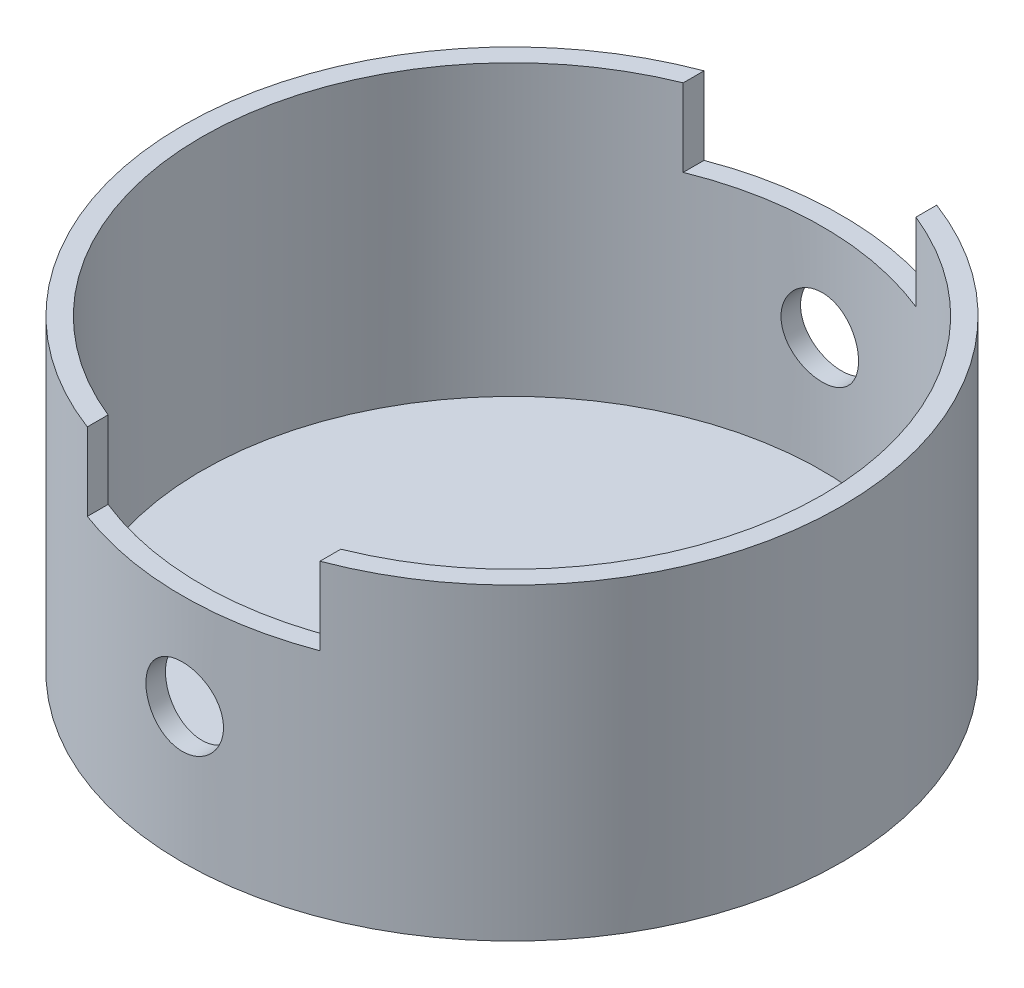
ISO-10303-21;
HEADER;
FILE_DESCRIPTION(('STEP AP214'),'2;1');
FILE_NAME('part.step','',(''),(''),'','','');
FILE_SCHEMA(('AUTOMOTIVE_DESIGN { 1 0 10303 214 1 1 1 1 }'));
ENDSEC;
DATA;
#1=APPLICATION_CONTEXT('core data for automotive mechanical design processes');
#2=APPLICATION_PROTOCOL_DEFINITION('international standard','automotive_design',2000,#1);
#3=PRODUCT_CONTEXT('',#1,'mechanical');
#4=PRODUCT('Part','Part','',(#3));
#5=PRODUCT_RELATED_PRODUCT_CATEGORY('part','',(#4));
#6=PRODUCT_DEFINITION_FORMATION('','',#4);
#7=PRODUCT_DEFINITION_CONTEXT('part definition',#1,'design');
#8=PRODUCT_DEFINITION('design','',#6,#7);
#9=PRODUCT_DEFINITION_SHAPE('','',#8);
#10=(LENGTH_UNIT() NAMED_UNIT(*) SI_UNIT(.MILLI.,.METRE.));
#11=(NAMED_UNIT(*) PLANE_ANGLE_UNIT() SI_UNIT($,.RADIAN.));
#12=(NAMED_UNIT(*) SI_UNIT($,.STERADIAN.) SOLID_ANGLE_UNIT());
#13=UNCERTAINTY_MEASURE_WITH_UNIT(LENGTH_MEASURE(1.E-05),#10,'distance_accuracy_value','');
#14=(GEOMETRIC_REPRESENTATION_CONTEXT(3) GLOBAL_UNCERTAINTY_ASSIGNED_CONTEXT((#13)) GLOBAL_UNIT_ASSIGNED_CONTEXT((#10,
#11,#12)) REPRESENTATION_CONTEXT('',''));
#15=CARTESIAN_POINT('',(0.,0.,0.));
#16=DIRECTION('',(0.,0.,1.));
#17=DIRECTION('',(1.,0.,0.));
#18=AXIS2_PLACEMENT_3D('',#15,#16,#17);
#19=CARTESIAN_POINT('',(0.,50.4952,0.));
#20=DIRECTION('',(0.,1.,0.));
#21=DIRECTION('',(0.,0.,1.));
#22=AXIS2_PLACEMENT_3D('',#19,#20,#21);
#23=PLANE('',#22);
#24=DIRECTION('',(0.,0.,1.));
#25=VECTOR('',#24,1.);
#26=CARTESIAN_POINT('',(-19.05,50.4952,-53.975));
#27=LINE('',#26,#25);
#28=CARTESIAN_POINT('',(-19.05,50.4952,-50.5014665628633));
#29=VERTEX_POINT('',#28);
#30=CARTESIAN_POINT('',(-19.05,50.4952,-47.0928603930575));
#31=VERTEX_POINT('',#30);
#32=EDGE_CURVE('E111',#29,#31,#27,.T.);
#33=ORIENTED_EDGE('',*,*,#32,.F.);
#34=CARTESIAN_POINT('',(0.,50.4952,0.));
#35=DIRECTION('',(0.,1.,0.));
#36=DIRECTION('',(0.,0.,1.));
#37=AXIS2_PLACEMENT_3D('',#34,#35,#36);
#38=CIRCLE('',#37,53.975);
#39=CARTESIAN_POINT('',(-19.05,50.4952,50.5014665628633));
#40=VERTEX_POINT('',#39);
#41=EDGE_CURVE('E149',#29,#40,#38,.T.);
#42=ORIENTED_EDGE('',*,*,#41,.T.);
#43=CARTESIAN_POINT('',(-19.05,50.4952,47.0928603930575));
#44=VERTEX_POINT('',#43);
#45=EDGE_CURVE('E189',#44,#40,#27,.T.);
#46=ORIENTED_EDGE('',*,*,#45,.F.);
#47=CARTESIAN_POINT('',(0.,50.4952,0.));
#48=DIRECTION('',(0.,1.,0.));
#49=DIRECTION('',(0.,0.,1.));
#50=AXIS2_PLACEMENT_3D('',#47,#48,#49);
#51=CIRCLE('',#50,50.8);
#52=EDGE_CURVE('E144',#31,#44,#51,.T.);
#53=ORIENTED_EDGE('',*,*,#52,.F.);
#54=EDGE_LOOP('',(#33,#42,#46,#53));
#55=FACE_BOUND('',#54,.T.);
#56=ADVANCED_FACE('F30',(#55),#23,.T.);
#57=CARTESIAN_POINT('',(0.,50.4952,0.));
#58=DIRECTION('',(0.,-1.,0.));
#59=DIRECTION('',(0.,0.,-1.));
#60=AXIS2_PLACEMENT_3D('',#57,#58,#59);
#61=CYLINDRICAL_SURFACE('',#60,53.975);
#62=CARTESIAN_POINT('',(0.,28.4226,-53.975));
#63=CARTESIAN_POINT('',(-0.177745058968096,28.4226019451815,-53.9750006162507));
#64=CARTESIAN_POINT('',(-0.355461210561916,28.415134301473,-53.9741202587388));
#65=CARTESIAN_POINT('',(-0.709680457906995,28.3853204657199,-53.9706247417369));
#66=CARTESIAN_POINT('',(-0.886183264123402,28.3629708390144,-53.9680091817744));
#67=CARTESIAN_POINT('',(-1.23678996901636,28.3035303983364,-53.9611133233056));
#68=CARTESIAN_POINT('',(-1.41089193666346,28.2664283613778,-53.9568317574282));
#69=CARTESIAN_POINT('',(-1.75538998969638,28.1777414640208,-53.9467231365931));
#70=CARTESIAN_POINT('',(-1.92578469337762,28.1261513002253,-53.9408955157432));
#71=CARTESIAN_POINT('',(-2.26142296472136,28.0089316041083,-53.9278663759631));
#72=CARTESIAN_POINT('',(-2.42667163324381,27.9433165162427,-53.9206662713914));
#73=CARTESIAN_POINT('',(-2.75110129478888,27.798463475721,-53.905087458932));
#74=CARTESIAN_POINT('',(-2.91028002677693,27.7192205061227,-53.8967083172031));
#75=CARTESIAN_POINT('',(-3.2213079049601,27.547743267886,-53.8790131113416));
#76=CARTESIAN_POINT('',(-3.37316107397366,27.4555162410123,-53.8696975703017));
#77=CARTESIAN_POINT('',(-3.66863392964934,27.2586535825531,-53.8503823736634));
#78=CARTESIAN_POINT('',(-3.81225054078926,27.154013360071,-53.8403824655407));
#79=CARTESIAN_POINT('',(-4.09075266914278,26.9326423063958,-53.8199400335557));
#80=CARTESIAN_POINT('',(-4.22560091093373,26.8158647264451,-53.8094958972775));
#81=CARTESIAN_POINT('',(-4.4850422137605,26.5713424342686,-53.7884929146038));
#82=CARTESIAN_POINT('',(-4.6096314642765,26.4435936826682,-53.7779340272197));
#83=CARTESIAN_POINT('',(-4.84758996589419,26.1781010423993,-53.7570066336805));
#84=CARTESIAN_POINT('',(-4.96096277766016,26.0403603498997,-53.7466380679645));
#85=CARTESIAN_POINT('',(-5.17577623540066,25.75575607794,-53.7263772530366));
#86=CARTESIAN_POINT('',(-5.27721246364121,25.6088891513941,-53.7164851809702));
#87=CARTESIAN_POINT('',(-5.46763329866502,25.3067088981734,-53.69743751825));
#88=CARTESIAN_POINT('',(-5.55658474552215,25.1513745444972,-53.6882839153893));
#89=CARTESIAN_POINT('',(-5.72111142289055,24.8336515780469,-53.671001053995));
#90=CARTESIAN_POINT('',(-5.79668168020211,24.6712603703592,-53.6628721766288));
#91=CARTESIAN_POINT('',(-5.93382829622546,24.3406773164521,-53.647880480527));
#92=CARTESIAN_POINT('',(-5.99541018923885,24.172487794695,-53.641017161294));
#93=CARTESIAN_POINT('',(-6.10418310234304,23.8314480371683,-53.6287471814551));
#94=CARTESIAN_POINT('',(-6.15136883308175,23.6585961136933,-53.6233410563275));
#95=CARTESIAN_POINT('',(-6.27032220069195,23.1366384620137,-53.6096110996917));
#96=CARTESIAN_POINT('',(-6.32027807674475,22.7822153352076,-53.6036860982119));
#97=CARTESIAN_POINT('',(-6.36001759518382,22.070163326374,-53.5989845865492));
#98=CARTESIAN_POINT('',(-6.34980339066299,21.7125345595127,-53.6002078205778));
#99=CARTESIAN_POINT('',(-6.26979696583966,21.0058890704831,-53.6096246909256));
#100=CARTESIAN_POINT('',(-6.20030552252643,20.6568380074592,-53.6177831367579));
#101=CARTESIAN_POINT('',(-6.00416501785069,19.975400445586,-53.6400995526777));
#102=CARTESIAN_POINT('',(-5.87751491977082,19.6430142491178,-53.6542576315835));
#103=CARTESIAN_POINT('',(-5.57033173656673,19.0033851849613,-53.6870173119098));
#104=CARTESIAN_POINT('',(-5.38966704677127,18.6962060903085,-53.7056297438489));
#105=CARTESIAN_POINT('',(-4.97967585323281,18.1164140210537,-53.7451926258));
#106=CARTESIAN_POINT('',(-4.75034737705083,17.8438024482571,-53.7661431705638));
#107=CARTESIAN_POINT('',(-4.24786730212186,17.3391357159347,-53.8081782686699));
#108=CARTESIAN_POINT('',(-3.97445621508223,17.1073388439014,-53.829262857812));
#109=CARTESIAN_POINT('',(-3.39246779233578,16.692889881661,-53.869070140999));
#110=CARTESIAN_POINT('',(-3.08389039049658,16.5102378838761,-53.8877928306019));
#111=CARTESIAN_POINT('',(-2.44013596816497,16.1992665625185,-53.9207765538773));
#112=CARTESIAN_POINT('',(-2.10495153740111,16.0709624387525,-53.9350363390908));
#113=CARTESIAN_POINT('',(-1.41759135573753,15.8725290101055,-53.9574758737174));
#114=CARTESIAN_POINT('',(-1.06541630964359,15.8023972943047,-53.9656558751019));
#115=CARTESIAN_POINT('',(-0.35630624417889,15.7226319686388,-53.9749815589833));
#116=CARTESIAN_POINT('',(0.000588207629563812,15.7126423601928,-53.9761686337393));
#117=CARTESIAN_POINT('',(0.710966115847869,15.7525067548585,-53.9714862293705));
#118=CARTESIAN_POINT('',(1.06444963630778,15.8023596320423,-53.9656168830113));
#119=CARTESIAN_POINT('',(1.75692840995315,15.9601982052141,-53.9475070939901));
#120=CARTESIAN_POINT('',(2.09596265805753,16.068015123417,-53.9352851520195));
#121=CARTESIAN_POINT('',(2.75113641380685,16.3385465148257,-53.9058393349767));
#122=CARTESIAN_POINT('',(3.06727522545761,16.5012626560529,-53.8886153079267));
#123=CARTESIAN_POINT('',(3.6692802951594,16.8778413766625,-53.8509842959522));
#124=CARTESIAN_POINT('',(3.95500087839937,17.0919353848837,-53.8305630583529));
#125=CARTESIAN_POINT('',(4.48657908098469,17.5648649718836,-53.7888693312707));
#126=CARTESIAN_POINT('',(4.73243530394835,17.8237021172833,-53.7675968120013));
#127=CARTESIAN_POINT('',(5.17856086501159,18.3803293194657,-53.7264711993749));
#128=CARTESIAN_POINT('',(5.37859495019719,18.6783085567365,-53.706625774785));
#129=CARTESIAN_POINT('',(5.72577355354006,19.3038564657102,-53.6707251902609));
#130=CARTESIAN_POINT('',(5.87291902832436,19.6314246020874,-53.654669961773));
#131=CARTESIAN_POINT('',(6.1097650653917,20.3060108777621,-53.6282167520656));
#132=CARTESIAN_POINT('',(6.19960057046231,20.6529812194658,-53.6178054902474));
#133=CARTESIAN_POINT('',(6.31968777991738,21.3574074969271,-53.6037871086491));
#134=CARTESIAN_POINT('',(6.34994191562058,21.7148630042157,-53.6001797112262));
#135=CARTESIAN_POINT('',(6.35002884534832,22.249589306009,-53.6001637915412));
#136=CARTESIAN_POINT('',(6.34258489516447,22.4271378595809,-53.6010486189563));
#137=CARTESIAN_POINT('',(6.31285908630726,22.7809533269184,-53.6045586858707));
#138=CARTESIAN_POINT('',(6.29058274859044,22.9572206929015,-53.6071832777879));
#139=CARTESIAN_POINT('',(6.23133914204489,23.307288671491,-53.6141017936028));
#140=CARTESIAN_POINT('',(6.19436651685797,23.4810883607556,-53.6183963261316));
#141=CARTESIAN_POINT('',(6.10602196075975,23.824877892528,-53.6285287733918));
#142=CARTESIAN_POINT('',(6.05465527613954,23.9948690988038,-53.6343661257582));
#143=CARTESIAN_POINT('',(5.93788577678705,24.3299192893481,-53.6474191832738));
#144=CARTESIAN_POINT('',(5.87248185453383,24.4949778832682,-53.654634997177));
#145=CARTESIAN_POINT('',(5.72813847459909,24.8189364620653,-53.6702368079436));
#146=CARTESIAN_POINT('',(5.64920394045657,24.9778386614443,-53.6786223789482));
#147=CARTESIAN_POINT('',(5.47831419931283,25.2885001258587,-53.69633205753));
#148=CARTESIAN_POINT('',(5.38635427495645,25.4402567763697,-53.7056565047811));
#149=CARTESIAN_POINT('',(5.19011973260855,25.7354622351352,-53.7249755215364));
#150=CARTESIAN_POINT('',(5.085849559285,25.8789140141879,-53.7349698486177));
#151=CARTESIAN_POINT('',(4.8650042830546,26.1574525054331,-53.7554158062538));
#152=CARTESIAN_POINT('',(4.74835606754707,26.292481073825,-53.7658699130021));
#153=CARTESIAN_POINT('',(4.50416326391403,26.5521951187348,-53.7868770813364));
#154=CARTESIAN_POINT('',(4.37662264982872,26.6768843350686,-53.7974301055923));
#155=CARTESIAN_POINT('',(4.11141832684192,26.9151754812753,-53.8183478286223));
#156=CARTESIAN_POINT('',(3.97374853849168,27.0287706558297,-53.8287124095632));
#157=CARTESIAN_POINT('',(3.68936773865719,27.2439487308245,-53.8489507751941));
#158=CARTESIAN_POINT('',(3.54266008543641,27.3455360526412,-53.8588247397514));
#159=CARTESIAN_POINT('',(3.24061319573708,27.5363861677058,-53.8778435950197));
#160=CARTESIAN_POINT('',(3.08524353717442,27.6256011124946,-53.8869856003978));
#161=CARTESIAN_POINT('',(2.7675370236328,27.7905775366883,-53.9042360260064));
#162=CARTESIAN_POINT('',(2.60520275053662,27.8663439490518,-53.9123448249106));
#163=CARTESIAN_POINT('',(2.27479166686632,28.003857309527,-53.9272960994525));
#164=CARTESIAN_POINT('',(2.10671952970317,28.0656153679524,-53.9341395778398));
#165=CARTESIAN_POINT('',(1.76596873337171,28.1747194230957,-53.9463720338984));
#166=CARTESIAN_POINT('',(1.59329118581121,28.2220688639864,-53.9517613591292));
#167=CARTESIAN_POINT('',(1.18649345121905,28.3153188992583,-53.9624574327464));
#168=CARTESIAN_POINT('',(0.951024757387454,28.3555087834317,-53.9671415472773));
#169=CARTESIAN_POINT('',(0.477020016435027,28.4091479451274,-53.9734124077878));
#170=CARTESIAN_POINT('',(0.238483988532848,28.4225973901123,-53.9749991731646));
#171=CARTESIAN_POINT('',(0.,28.4226,-53.975));
#172=B_SPLINE_CURVE_WITH_KNOTS('',3,(#62,#63,#64,#65,#66,#67,#68,#69,#70,#71,#72,#73,#74,#75,
#76,#77,#78,#79,#80,#81,#82,#83,#84,#85,#86,#87,#88,#89,#90,#91,#92,#93,#94,#95,#96,#97,#98,#99,
#100,#101,#102,#103,#104,#105,#106,#107,#108,#109,#110,#111,#112,#113,#114,#115,#116,#117,#118,
#119,#120,#121,#122,#123,#124,#125,#126,#127,#128,#129,#130,#131,#132,#133,#134,#135,#136,#137,
#138,#139,#140,#141,#142,#143,#144,#145,#146,#147,#148,#149,#150,#151,#152,#153,#154,#155,#156,
#157,#158,#159,#160,#161,#162,#163,#164,#165,#166,#167,#168,#169,#170,#171),.UNSPECIFIED.,.T.,
.F.,(4,2,2,2,2,2,2,2,2,2,2,2,2,2,2,2,2,2,2,2,2,2,2,2,2,2,2,2,2,2,2,2,2,2,2,2,2,2,2,2,2,2,2,2,2,
2,2,2,2,2,2,2,2,2,4),(0.,0.533026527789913,1.06617611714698,1.59973208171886,2.13348361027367,
2.66668804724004,3.20008919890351,3.73319401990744,4.26649662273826,4.80193530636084,
5.33757198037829,5.87303806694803,6.40870171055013,6.94576220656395,7.48302188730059,
8.02006863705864,8.55731246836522,9.62565526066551,10.6939598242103,11.7568757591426,
12.8198109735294,13.8853573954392,14.9509470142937,16.023054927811,17.0951648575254,
18.1675744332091,19.2399395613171,20.3059507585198,21.3719418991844,22.4348458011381,
23.4977820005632,24.5655991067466,25.633453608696,26.7066734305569,27.7798738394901,
28.8505378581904,29.9211581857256,30.4537600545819,30.9861637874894,31.5187617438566,
32.0511658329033,32.5836119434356,33.1158647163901,33.6483107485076,34.1805651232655,
34.7161596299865,35.2515595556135,35.7872834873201,36.3228095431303,36.8603521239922,
37.3976971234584,37.9346144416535,38.4714033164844,39.1865798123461,39.9017518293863),.UNSPECIFIED.);
#173=CARTESIAN_POINT('',(0.,28.4226,-53.975));
#174=VERTEX_POINT('',#173);
#175=EDGE_CURVE('E133',#174,#174,#172,.T.);
#176=ORIENTED_EDGE('',*,*,#175,.T.);
#177=EDGE_LOOP('',(#176));
#178=FACE_BOUND('',#177,.T.);
#179=CARTESIAN_POINT('',(6.35,22.0726,53.6001690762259));
#180=CARTESIAN_POINT('',(6.35000194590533,21.8948597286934,53.6001684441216));
#181=CARTESIAN_POINT('',(6.34253470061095,21.7171483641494,53.6010549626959));
#182=CARTESIAN_POINT('',(6.31272249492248,21.3629388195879,53.6045743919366));
#183=CARTESIAN_POINT('',(6.29037409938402,21.1864409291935,53.6072077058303));
#184=CARTESIAN_POINT('',(6.23093702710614,20.8358441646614,53.6141486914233));
#185=CARTESIAN_POINT('',(6.19383712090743,20.6617472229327,53.6184576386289));
#186=CARTESIAN_POINT('',(6.10515548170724,20.3172593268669,53.628627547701));
#187=CARTESIAN_POINT('',(6.05356844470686,20.1468697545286,53.6344890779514));
#188=CARTESIAN_POINT('',(5.93635630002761,19.8112423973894,53.6475886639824));
#189=CARTESIAN_POINT('',(5.87074569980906,19.6459994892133,53.6548252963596));
#190=CARTESIAN_POINT('',(5.7259027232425,19.3215808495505,53.6704757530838));
#191=CARTESIAN_POINT('',(5.64666533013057,19.1624073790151,53.6788900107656));
#192=CARTESIAN_POINT('',(5.47520009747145,18.8513890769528,53.6966500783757));
#193=CARTESIAN_POINT('',(5.38297949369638,18.6995402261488,53.7059953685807));
#194=CARTESIAN_POINT('',(5.18613027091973,18.404074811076,53.7253614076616));
#195=CARTESIAN_POINT('',(5.08149706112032,18.2604613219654,53.7353824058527));
#196=CARTESIAN_POINT('',(4.86013300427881,17.9819548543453,53.7558567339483));
#197=CARTESIAN_POINT('',(4.74335463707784,17.8470997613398,53.7663116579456));
#198=CARTESIAN_POINT('',(4.49882932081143,17.5876446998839,53.7873239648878));
#199=CARTESIAN_POINT('',(4.37107833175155,17.4630485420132,53.7978813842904));
#200=CARTESIAN_POINT('',(4.1055798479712,17.2250765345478,53.8187937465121));
#201=CARTESIAN_POINT('',(3.96783555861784,17.1116971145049,53.8291487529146));
#202=CARTESIAN_POINT('',(3.68322274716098,16.896870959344,53.8493718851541));
#203=CARTESIAN_POINT('',(3.53635087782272,16.7954286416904,53.859239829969));
#204=CARTESIAN_POINT('',(3.23416674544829,16.6050009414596,53.8782308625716));
#205=CARTESIAN_POINT('',(3.07883383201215,16.5160481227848,53.8873519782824));
#206=CARTESIAN_POINT('',(2.76111364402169,16.3515185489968,53.9045656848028));
#207=CARTESIAN_POINT('',(2.59872377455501,16.2759467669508,53.9126578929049));
#208=CARTESIAN_POINT('',(2.2681434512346,16.1387970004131,53.9275762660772));
#209=CARTESIAN_POINT('',(2.09995531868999,16.0772134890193,53.9344029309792));
#210=CARTESIAN_POINT('',(1.75891861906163,15.9684372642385,53.9466037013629));
#211=CARTESIAN_POINT('',(1.58606836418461,15.9212498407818,53.9519772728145));
#212=CARTESIAN_POINT('',(1.06411813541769,15.8022915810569,53.9656219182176));
#213=CARTESIAN_POINT('',(0.709701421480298,15.7523319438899,53.9715060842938));
#214=CARTESIAN_POINT('',(-0.00233801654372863,15.7125826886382,53.9761763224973));
#215=CARTESIAN_POINT('',(-0.359960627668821,15.7227909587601,53.9749626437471));
#216=CARTESIAN_POINT('',(-1.06663214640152,15.8027879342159,53.9656105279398));
#217=CARTESIAN_POINT('',(-1.41571469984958,15.8722818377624,53.9575063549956));
#218=CARTESIAN_POINT('',(-2.09721396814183,16.0684381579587,53.9353193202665));
#219=CARTESIAN_POINT('',(-2.42963039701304,16.1951015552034,53.921236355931));
#220=CARTESIAN_POINT('',(-3.06929631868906,16.5023123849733,53.8886161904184));
#221=CARTESIAN_POINT('',(-3.37648353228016,16.682988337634,53.8700683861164));
#222=CARTESIAN_POINT('',(-3.95628707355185,17.0930036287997,53.8305953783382));
#223=CARTESIAN_POINT('',(-4.22890199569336,17.3223449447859,53.8096700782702));
#224=CARTESIAN_POINT('',(-4.73355442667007,17.8248341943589,53.7676364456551));
#225=CARTESIAN_POINT('',(-4.96533623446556,18.0982389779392,53.7465277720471));
#226=CARTESIAN_POINT('',(-5.37975779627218,18.6802093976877,53.706631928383));
#227=CARTESIAN_POINT('',(-5.5623974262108,18.9887751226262,53.6878447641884));
#228=CARTESIAN_POINT('',(-5.87335982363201,19.632526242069,53.6547188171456));
#229=CARTESIAN_POINT('',(-6.00166359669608,19.9677208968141,53.6403815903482));
#230=CARTESIAN_POINT('',(-6.20009319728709,20.6551033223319,53.6178098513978));
#231=CARTESIAN_POINT('',(-6.27022149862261,21.0072903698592,53.6095750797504));
#232=CARTESIAN_POINT('',(-6.34997392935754,21.71640623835,53.6001873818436));
#233=CARTESIAN_POINT('',(-6.3599572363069,22.0732941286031,53.5989924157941));
#234=CARTESIAN_POINT('',(-6.32008258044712,22.7836574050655,53.603708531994));
#235=CARTESIAN_POINT('',(-6.27022574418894,23.1371328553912,53.6096194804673));
#236=CARTESIAN_POINT('',(-6.11238789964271,23.8295703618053,53.6278430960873));
#237=CARTESIAN_POINT('',(-6.00457951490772,24.1685723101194,53.6401367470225));
#238=CARTESIAN_POINT('',(-5.7340759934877,24.8236852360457,53.66972518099));
#239=CARTESIAN_POINT('',(-5.57137913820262,25.1397954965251,53.6870201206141));
#240=CARTESIAN_POINT('',(-5.19482900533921,25.7417807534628,53.7247635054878));
#241=CARTESIAN_POINT('',(-4.98073940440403,26.0275070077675,53.7452263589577));
#242=CARTESIAN_POINT('',(-4.50781526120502,26.5590987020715,53.7869540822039));
#243=CARTESIAN_POINT('',(-4.24897918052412,26.804962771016,53.8082189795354));
#244=CARTESIAN_POINT('',(-3.69234862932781,27.2511058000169,53.8492833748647));
#245=CARTESIAN_POINT('',(-3.39436477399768,27.451149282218,53.8690749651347));
#246=CARTESIAN_POINT('',(-2.76880507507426,27.7983443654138,53.9048450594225));
#247=CARTESIAN_POINT('',(-2.44122976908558,27.9454969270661,53.9208236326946));
#248=CARTESIAN_POINT('',(-1.76664760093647,28.1823475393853,53.9471339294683));
#249=CARTESIAN_POINT('',(-1.41968962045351,28.2721836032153,53.9574792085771));
#250=CARTESIAN_POINT('',(-0.715289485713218,28.3922761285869,53.9714064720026));
#251=CARTESIAN_POINT('',(-0.357847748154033,28.4225349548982,53.9749887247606));
#252=CARTESIAN_POINT('',(0.176875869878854,28.4226322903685,53.9750056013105));
#253=CARTESIAN_POINT('',(0.354434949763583,28.4151909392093,53.9741273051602));
#254=CARTESIAN_POINT('',(0.708271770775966,28.3854685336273,53.9706416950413));
#255=CARTESIAN_POINT('',(0.884549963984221,28.3631930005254,53.9680350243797));
#256=CARTESIAN_POINT('',(1.23463975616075,28.3039491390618,53.9611618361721));
#257=CARTESIAN_POINT('',(1.40845043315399,28.2669754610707,53.9568947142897));
#258=CARTESIAN_POINT('',(1.75226196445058,28.1786268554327,53.9468234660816));
#259=CARTESIAN_POINT('',(1.92226418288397,28.127257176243,53.9410198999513));
#260=CARTESIAN_POINT('',(2.25733708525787,28.0104793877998,53.9280369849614));
#261=CARTESIAN_POINT('',(2.42240734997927,27.9450700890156,53.9208575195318));
#262=CARTESIAN_POINT('',(2.74638844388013,27.8007139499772,53.9053269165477));
#263=CARTESIAN_POINT('',(2.9053014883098,27.7217720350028,53.8969762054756));
#264=CARTESIAN_POINT('',(3.21598328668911,27.5508657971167,53.8793308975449));
#265=CARTESIAN_POINT('',(3.36774942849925,27.4588967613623,53.8700359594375));
#266=CARTESIAN_POINT('',(3.66297213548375,27.262642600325,53.850767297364));
#267=CARTESIAN_POINT('',(3.80643167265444,27.158361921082,53.8407938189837));
#268=CARTESIAN_POINT('',(4.08496993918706,26.9375054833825,53.8203796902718));
#269=CARTESIAN_POINT('',(4.21999143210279,26.8208577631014,53.8099365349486));
#270=CARTESIAN_POINT('',(4.47969125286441,26.5766674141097,53.7889390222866));
#271=CARTESIAN_POINT('',(4.60437332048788,26.4491287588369,53.7783847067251));
#272=CARTESIAN_POINT('',(4.84265042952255,26.1839297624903,53.7574523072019));
#273=CARTESIAN_POINT('',(4.95623870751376,26.0462633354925,53.7470743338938));
#274=CARTESIAN_POINT('',(5.17140349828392,25.7618906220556,53.7267985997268));
#275=CARTESIAN_POINT('',(5.27298443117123,25.6151876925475,53.7169006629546));
#276=CARTESIAN_POINT('',(5.46382704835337,25.3131443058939,53.6978254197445));
#277=CARTESIAN_POINT('',(5.55304029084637,25.157773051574,53.6886510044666));
#278=CARTESIAN_POINT('',(5.71801314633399,24.8400634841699,53.6713315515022));
#279=CARTESIAN_POINT('',(5.79377769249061,24.6777277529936,53.6631861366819));
#280=CARTESIAN_POINT('',(5.93128720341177,24.3473137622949,53.6481616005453));
#281=CARTESIAN_POINT('',(5.99304328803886,24.1792401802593,53.6412814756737));
#282=CARTESIAN_POINT('',(6.10214331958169,23.8384862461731,53.6289798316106));
#283=CARTESIAN_POINT('',(6.1494907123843,23.6658070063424,53.6235579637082));
#284=CARTESIAN_POINT('',(6.24273196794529,23.2590216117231,53.6127955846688));
#285=CARTESIAN_POINT('',(6.28291693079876,23.0235672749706,53.6080805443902));
#286=CARTESIAN_POINT('',(6.33654955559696,22.5495912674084,53.6017677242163));
#287=CARTESIAN_POINT('',(6.34999738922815,22.3110696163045,53.6001699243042));
#288=CARTESIAN_POINT('',(6.35,22.0726,53.6001690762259));
#289=B_SPLINE_CURVE_WITH_KNOTS('',3,(#179,#180,#181,#182,#183,#184,#185,#186,#187,#188,#189,
#190,#191,#192,#193,#194,#195,#196,#197,#198,#199,#200,#201,#202,#203,#204,#205,#206,#207,#208,
#209,#210,#211,#212,#213,#214,#215,#216,#217,#218,#219,#220,#221,#222,#223,#224,#225,#226,#227,
#228,#229,#230,#231,#232,#233,#234,#235,#236,#237,#238,#239,#240,#241,#242,#243,#244,#245,#246,
#247,#248,#249,#250,#251,#252,#253,#254,#255,#256,#257,#258,#259,#260,#261,#262,#263,#264,#265,
#266,#267,#268,#269,#270,#271,#272,#273,#274,#275,#276,#277,#278,#279,#280,#281,#282,#283,#284,
#285,#286,#287,#288),.UNSPECIFIED.,.T.,.F.,(4,2,2,2,2,2,2,2,2,2,2,2,2,2,2,2,2,2,2,2,2,2,2,2,2,2,
2,2,2,2,2,2,2,2,2,2,2,2,2,2,2,2,2,2,2,2,2,2,2,2,2,2,2,2,4),(0.,0.533012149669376,
1.06614738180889,1.59968923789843,2.13342668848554,2.66661463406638,3.19999929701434,
3.73308786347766,4.26637421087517,4.80183179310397,5.33748737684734,5.87297190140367,
6.40865396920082,6.94570776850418,7.48296074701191,8.02000108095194,8.5572385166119,
9.62556291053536,10.6938498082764,11.7568553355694,12.8198790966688,13.8854526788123,
14.9510695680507,16.0231390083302,17.0952111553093,18.1676577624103,19.2400587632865,
20.3060491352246,21.3720194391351,22.4348319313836,23.497677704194,24.5655077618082,
25.6333745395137,26.7066118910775,27.7798297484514,28.8504535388,29.9210348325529,
30.4536678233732,30.9861026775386,31.518731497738,32.0511663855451,32.5836464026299,
33.1159330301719,33.6484127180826,34.1807006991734,34.7162763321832,35.2516573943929,
35.7873628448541,36.3228704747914,36.8604196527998,37.3977712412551,37.9346947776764,
38.4714898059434,39.1866232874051,39.9017521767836),.UNSPECIFIED.);
#290=CARTESIAN_POINT('',(6.35,22.0726,53.6001690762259));
#291=VERTEX_POINT('',#290);
#292=EDGE_CURVE('E182',#291,#291,#289,.T.);
#293=ORIENTED_EDGE('',*,*,#292,.T.);
#294=EDGE_LOOP('',(#293));
#295=FACE_BOUND('',#294,.T.);
#296=CARTESIAN_POINT('',(19.05,50.4952,50.5014665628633));
#297=VERTEX_POINT('',#296);
#298=CARTESIAN_POINT('',(19.05,50.4952,-50.5014665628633));
#299=VERTEX_POINT('',#298);
#300=EDGE_CURVE('E152',#297,#299,#38,.T.);
#301=ORIENTED_EDGE('',*,*,#300,.F.);
#302=DIRECTION('',(0.,-1.,0.));
#303=VECTOR('',#302,1.);
#304=CARTESIAN_POINT('',(19.05,50.4952,50.5014665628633));
#305=LINE('',#304,#303);
#306=CARTESIAN_POINT('',(19.05,37.7952,50.5014665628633));
#307=VERTEX_POINT('',#306);
#308=EDGE_CURVE('E120',#297,#307,#305,.T.);
#309=ORIENTED_EDGE('',*,*,#308,.T.);
#310=CARTESIAN_POINT('',(0.,37.7952,0.));
#311=DIRECTION('',(0.,-1.,0.));
#312=DIRECTION('',(1.,0.,0.));
#313=AXIS2_PLACEMENT_3D('',#310,#311,#312);
#314=CIRCLE('',#313,53.975);
#315=CARTESIAN_POINT('',(-19.05,37.7952,50.5014665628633));
#316=VERTEX_POINT('',#315);
#317=EDGE_CURVE('E110',#307,#316,#314,.T.);
#318=ORIENTED_EDGE('',*,*,#317,.T.);
#319=DIRECTION('',(0.,-1.,0.));
#320=VECTOR('',#319,1.);
#321=CARTESIAN_POINT('',(-19.05,50.4952,50.5014665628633));
#322=LINE('',#321,#320);
#323=EDGE_CURVE('E137',#316,#40,#322,.F.);
#324=ORIENTED_EDGE('',*,*,#323,.T.);
#325=ORIENTED_EDGE('',*,*,#41,.F.);
#326=DIRECTION('',(0.,-1.,0.));
#327=VECTOR('',#326,1.);
#328=CARTESIAN_POINT('',(-19.05,50.4952,-50.5014665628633));
#329=LINE('',#328,#327);
#330=CARTESIAN_POINT('',(-19.05,37.7952,-50.5014665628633));
#331=VERTEX_POINT('',#330);
#332=EDGE_CURVE('E108',#29,#331,#329,.T.);
#333=ORIENTED_EDGE('',*,*,#332,.T.);
#334=CARTESIAN_POINT('',(19.05,37.7952,-50.5014665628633));
#335=VERTEX_POINT('',#334);
#336=EDGE_CURVE('E101',#331,#335,#314,.T.);
#337=ORIENTED_EDGE('',*,*,#336,.T.);
#338=DIRECTION('',(0.,-1.,0.));
#339=VECTOR('',#338,1.);
#340=CARTESIAN_POINT('',(19.05,50.4952,-50.5014665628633));
#341=LINE('',#340,#339);
#342=EDGE_CURVE('E105',#335,#299,#341,.F.);
#343=ORIENTED_EDGE('',*,*,#342,.T.);
#344=EDGE_LOOP('',(#301,#309,#318,#324,#325,#333,#337,#343));
#345=FACE_BOUND('',#344,.T.);
#346=CARTESIAN_POINT('',(0.,0.,0.));
#347=DIRECTION('',(0.,1.,0.));
#348=DIRECTION('',(0.,0.,1.));
#349=AXIS2_PLACEMENT_3D('',#346,#347,#348);
#350=CIRCLE('',#349,53.975);
#351=CARTESIAN_POINT('',(0.,0.,53.975));
#352=VERTEX_POINT('',#351);
#353=EDGE_CURVE('E148',#352,#352,#350,.T.);
#354=ORIENTED_EDGE('',*,*,#353,.T.);
#355=EDGE_LOOP('',(#354));
#356=FACE_BOUND('',#355,.T.);
#357=ADVANCED_FACE('F32',(#178,#295,#345,#356),#61,.T.);
#358=DIRECTION('',(0.,0.,1.));
#359=VECTOR('',#358,1.);
#360=CARTESIAN_POINT('',(19.05,50.4952,-53.975));
#361=LINE('',#360,#359);
#362=CARTESIAN_POINT('',(19.05,50.4952,47.0928603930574));
#363=VERTEX_POINT('',#362);
#364=EDGE_CURVE('E125',#363,#297,#361,.T.);
#365=ORIENTED_EDGE('',*,*,#364,.T.);
#366=ORIENTED_EDGE('',*,*,#300,.T.);
#367=CARTESIAN_POINT('',(19.05,50.4952,-47.0928603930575));
#368=VERTEX_POINT('',#367);
#369=EDGE_CURVE('E119',#299,#368,#361,.T.);
#370=ORIENTED_EDGE('',*,*,#369,.T.);
#371=EDGE_CURVE('E145',#363,#368,#51,.T.);
#372=ORIENTED_EDGE('',*,*,#371,.F.);
#373=EDGE_LOOP('',(#365,#366,#370,#372));
#374=FACE_BOUND('',#373,.T.);
#375=ADVANCED_FACE('F195',(#374),#23,.T.);
#376=CARTESIAN_POINT('',(0.,0.,0.));
#377=DIRECTION('',(0.,1.,0.));
#378=DIRECTION('',(0.,0.,1.));
#379=AXIS2_PLACEMENT_3D('',#376,#377,#378);
#380=PLANE('',#379);
#381=ORIENTED_EDGE('',*,*,#353,.F.);
#382=EDGE_LOOP('',(#381));
#383=FACE_BOUND('',#382,.T.);
#384=ADVANCED_FACE('F222',(#383),#380,.F.);
#385=CARTESIAN_POINT('',(0.,50.4952,0.));
#386=DIRECTION('',(0.,-1.,0.));
#387=DIRECTION('',(0.,0.,-1.));
#388=AXIS2_PLACEMENT_3D('',#385,#386,#387);
#389=CYLINDRICAL_SURFACE('',#388,50.8);
#390=CARTESIAN_POINT('',(0.,28.4226,-50.8));
#391=CARTESIAN_POINT('',(-0.177660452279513,28.4226020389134,-50.800000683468));
#392=CARTESIAN_POINT('',(-0.35529097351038,28.4151414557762,-50.7990661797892));
#393=CARTESIAN_POINT('',(-0.709338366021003,28.3853564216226,-50.7953557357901));
#394=CARTESIAN_POINT('',(-0.885754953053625,28.3630286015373,-50.7925793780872));
#395=CARTESIAN_POINT('',(-1.23618570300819,28.3036476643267,-50.7852595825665));
#396=CARTESIAN_POINT('',(-1.4101979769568,28.2665835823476,-50.780714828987));
#397=CARTESIAN_POINT('',(-1.75451712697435,28.1779895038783,-50.7699847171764));
#398=CARTESIAN_POINT('',(-1.92482262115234,28.1264542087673,-50.7637987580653));
#399=CARTESIAN_POINT('',(-2.26028082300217,28.0093633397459,-50.7499683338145));
#400=CARTESIAN_POINT('',(-2.42543874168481,27.943822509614,-50.7423254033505));
#401=CARTESIAN_POINT('',(-2.74969172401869,27.7991369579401,-50.7257879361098));
#402=CARTESIAN_POINT('',(-2.90878452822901,27.7199872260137,-50.7168929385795));
#403=CARTESIAN_POINT('',(-3.21964998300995,27.5487144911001,-50.6981073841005));
#404=CARTESIAN_POINT('',(-3.37142659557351,27.4565986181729,-50.6882173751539));
#405=CARTESIAN_POINT('',(-3.66675816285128,27.2599757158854,-50.667709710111));
#406=CARTESIAN_POINT('',(-3.81031004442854,27.1554640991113,-50.6570917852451));
#407=CARTESIAN_POINT('',(-4.08877364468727,26.9343061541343,-50.6353782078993));
#408=CARTESIAN_POINT('',(-4.22364310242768,26.8176068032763,-50.6242806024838));
#409=CARTESIAN_POINT('',(-4.48313482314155,26.5732418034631,-50.601961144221));
#410=CARTESIAN_POINT('',(-4.60775327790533,26.4455721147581,-50.5907392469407));
#411=CARTESIAN_POINT('',(-4.84578010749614,26.1802355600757,-50.5684951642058));
#412=CARTESIAN_POINT('',(-4.95919202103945,26.0425718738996,-50.5574729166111));
#413=CARTESIAN_POINT('',(-5.17409430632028,25.7581168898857,-50.5359319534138));
#414=CARTESIAN_POINT('',(-5.27558026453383,25.6113222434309,-50.5254134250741));
#415=CARTESIAN_POINT('',(-5.46614935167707,25.309218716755,-50.5051524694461));
#416=CARTESIAN_POINT('',(-5.5551942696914,25.1538855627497,-50.4954124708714));
#417=CARTESIAN_POINT('',(-5.71990676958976,24.8361494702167,-50.4770198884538));
#418=CARTESIAN_POINT('',(-5.79556937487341,24.6737439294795,-50.4683677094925));
#419=CARTESIAN_POINT('',(-5.93289692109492,24.3431168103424,-50.4524085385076));
#420=CARTESIAN_POINT('',(-5.99456744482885,24.1748975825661,-50.4451010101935));
#421=CARTESIAN_POINT('',(-6.10351153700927,23.8337833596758,-50.4320345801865));
#422=CARTESIAN_POINT('',(-6.15077981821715,23.6608866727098,-50.4262762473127));
#423=CARTESIAN_POINT('',(-6.26991974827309,23.1389812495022,-50.4116539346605));
#424=CARTESIAN_POINT('',(-6.32000152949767,22.7846432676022,-50.4053374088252));
#425=CARTESIAN_POINT('',(-6.36001442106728,22.0727333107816,-50.4003032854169));
#426=CARTESIAN_POINT('',(-6.34994795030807,21.7151614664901,-50.4015853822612));
#427=CARTESIAN_POINT('',(-6.2702829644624,21.0088500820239,-50.411557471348));
#428=CARTESIAN_POINT('',(-6.20102456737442,20.6600717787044,-50.4202051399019));
#429=CARTESIAN_POINT('',(-6.00545126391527,19.9791408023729,-50.4438714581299));
#430=CARTESIAN_POINT('',(-5.87913520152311,19.646988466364,-50.4588902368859));
#431=CARTESIAN_POINT('',(-5.57267217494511,19.007664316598,-50.4936536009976));
#432=CARTESIAN_POINT('',(-5.39237737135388,18.7005640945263,-50.5134111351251));
#433=CARTESIAN_POINT('',(-4.98317902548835,18.1208507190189,-50.5554160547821));
#434=CARTESIAN_POINT('',(-4.75427325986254,17.8482391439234,-50.5776635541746));
#435=CARTESIAN_POINT('',(-4.25246571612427,17.3432655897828,-50.622329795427));
#436=CARTESIAN_POINT('',(-3.97927069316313,17.1111949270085,-50.6447486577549));
#437=CARTESIAN_POINT('',(-3.39764921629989,16.6961594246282,-50.6870876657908));
#438=CARTESIAN_POINT('',(-3.08922268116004,16.5131946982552,-50.7070078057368));
#439=CARTESIAN_POINT('',(-2.44566864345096,16.2015644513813,-50.7421172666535));
#440=CARTESIAN_POINT('',(-2.11053221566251,16.0729171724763,-50.7573049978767));
#441=CARTESIAN_POINT('',(-1.42318216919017,15.8738049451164,-50.7812239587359));
#442=CARTESIAN_POINT('',(-1.07096935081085,15.8033372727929,-50.7899554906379));
#443=CARTESIAN_POINT('',(-0.361983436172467,15.7229621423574,-50.7999389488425));
#444=CARTESIAN_POINT('',(-0.00525650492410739,15.7126533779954,-50.8012404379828));
#445=CARTESIAN_POINT('',(0.70483993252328,15.751829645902,-50.7963509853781));
#446=CARTESIAN_POINT('',(1.05820951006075,15.8013134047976,-50.7901602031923));
#447=CARTESIAN_POINT('',(1.75037625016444,15.9583366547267,-50.7710127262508));
#448=CARTESIAN_POINT('',(2.08921749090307,16.0656847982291,-50.7580783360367));
#449=CARTESIAN_POINT('',(2.74408812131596,16.3351907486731,-50.7268917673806));
#450=CARTESIAN_POINT('',(3.06011673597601,16.4973504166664,-50.7086394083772));
#451=CARTESIAN_POINT('',(3.66218349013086,16.8728468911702,-50.6687282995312));
#452=CARTESIAN_POINT('',(3.94805857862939,17.0864432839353,-50.6470524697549));
#453=CARTESIAN_POINT('',(4.48004432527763,17.5583840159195,-50.6027726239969));
#454=CARTESIAN_POINT('',(4.7261534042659,17.8167301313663,-50.5801685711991));
#455=CARTESIAN_POINT('',(5.1730452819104,18.3725997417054,-50.5364268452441));
#456=CARTESIAN_POINT('',(5.37356206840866,18.6703378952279,-50.5152982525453));
#457=CARTESIAN_POINT('',(5.72173794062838,19.2955160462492,-50.4770495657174));
#458=CARTESIAN_POINT('',(5.86939808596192,19.6229554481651,-50.4599293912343));
#459=CARTESIAN_POINT('',(6.10724499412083,20.2973160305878,-50.4316957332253));
#460=CARTESIAN_POINT('',(6.19758172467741,20.6441837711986,-50.420566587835));
#461=CARTESIAN_POINT('',(6.31867625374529,21.3485092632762,-50.405537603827));
#462=CARTESIAN_POINT('',(6.34943682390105,21.7059665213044,-50.4016374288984));
#463=CARTESIAN_POINT('',(6.35026929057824,22.2406145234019,-50.401526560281));
#464=CARTESIAN_POINT('',(6.34308284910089,22.4180517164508,-50.4024350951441));
#465=CARTESIAN_POINT('',(6.3138908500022,22.7716657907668,-50.4061013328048));
#466=CARTESIAN_POINT('',(6.29189081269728,22.9478431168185,-50.4088583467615));
#467=CARTESIAN_POINT('',(6.23321749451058,23.2977525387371,-50.4161467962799));
#468=CARTESIAN_POINT('',(6.1965388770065,23.4714837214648,-50.4206788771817));
#469=CARTESIAN_POINT('',(6.10879888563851,23.8151590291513,-50.4313843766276));
#470=CARTESIAN_POINT('',(6.05774274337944,23.9851045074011,-50.4375571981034));
#471=CARTESIAN_POINT('',(5.94161476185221,24.320073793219,-50.4513689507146));
#472=CARTESIAN_POINT('',(5.87654296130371,24.4850976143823,-50.4590078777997));
#473=CARTESIAN_POINT('',(5.73288012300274,24.8090144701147,-50.475531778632));
#474=CARTESIAN_POINT('',(5.65429399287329,24.9679097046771,-50.4844162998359));
#475=CARTESIAN_POINT('',(5.48411509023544,25.27858877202,-50.5031861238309));
#476=CARTESIAN_POINT('',(5.39251755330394,25.4303699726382,-50.5130717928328));
#477=CARTESIAN_POINT('',(5.19701859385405,25.7256590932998,-50.5335596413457));
#478=CARTESIAN_POINT('',(5.09312159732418,25.8691699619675,-50.5441615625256));
#479=CARTESIAN_POINT('',(4.87294741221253,26.1479719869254,-50.5658649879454));
#480=CARTESIAN_POINT('',(4.7565881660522,26.2831981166,-50.5769694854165));
#481=CARTESIAN_POINT('',(4.5129587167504,26.5433324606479,-50.5992900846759));
#482=CARTESIAN_POINT('',(4.38569248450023,26.6682443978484,-50.6105061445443));
#483=CARTESIAN_POINT('',(4.12101889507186,26.9070065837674,-50.6327447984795));
#484=CARTESIAN_POINT('',(3.98360546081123,27.0208501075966,-50.6437672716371));
#485=CARTESIAN_POINT('',(3.69971470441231,27.2365500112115,-50.6652974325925));
#486=CARTESIAN_POINT('',(3.55324074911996,27.3384108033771,-50.675805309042));
#487=CARTESIAN_POINT('',(3.25157211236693,27.5298728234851,-50.6960572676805));
#488=CARTESIAN_POINT('',(3.09634349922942,27.6194209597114,-50.7057979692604));
#489=CARTESIAN_POINT('',(2.77888304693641,27.7850735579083,-50.7241863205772));
#490=CARTESIAN_POINT('',(2.6166538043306,27.8611829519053,-50.7328343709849));
#491=CARTESIAN_POINT('',(2.28641311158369,27.9993887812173,-50.7487892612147));
#492=CARTESIAN_POINT('',(2.1184062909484,28.0614961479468,-50.7560971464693));
#493=CARTESIAN_POINT('',(1.77774856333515,28.171299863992,-50.7691705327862));
#494=CARTESIAN_POINT('',(1.60509876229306,28.2189996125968,-50.7749363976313));
#495=CARTESIAN_POINT('',(1.19645220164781,28.313494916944,-50.7864482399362));
#496=CARTESIAN_POINT('',(0.959041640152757,28.3543672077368,-50.7915088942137));
#497=CARTESIAN_POINT('',(0.481069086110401,28.4089182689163,-50.7982842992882));
#498=CARTESIAN_POINT('',(0.240507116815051,28.4225972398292,-50.799999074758));
#499=CARTESIAN_POINT('',(0.,28.4226,-50.8));
#500=B_SPLINE_CURVE_WITH_KNOTS('',3,(#390,#391,#392,#393,#394,#395,#396,#397,#398,#399,#400,
#401,#402,#403,#404,#405,#406,#407,#408,#409,#410,#411,#412,#413,#414,#415,#416,#417,#418,#419,
#420,#421,#422,#423,#424,#425,#426,#427,#428,#429,#430,#431,#432,#433,#434,#435,#436,#437,#438,
#439,#440,#441,#442,#443,#444,#445,#446,#447,#448,#449,#450,#451,#452,#453,#454,#455,#456,#457,
#458,#459,#460,#461,#462,#463,#464,#465,#466,#467,#468,#469,#470,#471,#472,#473,#474,#475,#476,
#477,#478,#479,#480,#481,#482,#483,#484,#485,#486,#487,#488,#489,#490,#491,#492,#493,#494,#495,
#496,#497,#498,#499),.UNSPECIFIED.,.T.,.F.,(4,2,2,2,2,2,2,2,2,2,2,2,2,2,2,2,2,2,2,2,2,2,2,2,2,2,
2,2,2,2,2,2,2,2,2,2,2,2,2,2,2,2,2,2,2,2,2,2,2,2,2,2,2,2,4),(0.,0.532770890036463,
1.06566255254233,1.59895146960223,2.13243590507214,2.66536147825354,3.19848368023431,
3.73131385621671,4.26434184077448,4.79979383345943,5.33544385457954,5.87092418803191,
6.40660207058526,6.94389065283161,7.48137862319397,8.0186517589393,8.55612189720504,
9.62427916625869,10.6923934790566,11.7544113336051,12.8164507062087,13.8814258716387,
14.9464497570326,16.0188371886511,17.0912270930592,18.1639768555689,19.2366763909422,
20.3022119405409,21.3677247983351,22.4297356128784,23.4917824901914,24.5593058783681,
25.6268716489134,26.7005149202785,27.7741366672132,28.8449379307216,29.915689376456,
30.4479262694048,30.9799649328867,31.512197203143,32.0442360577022,32.5762734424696,
33.1081180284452,33.640157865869,34.1720068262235,34.7076024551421,35.2430039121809,
35.7787286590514,36.3142555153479,36.8520236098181,37.3895939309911,37.9267431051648,
38.4637654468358,39.1850071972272,39.9062436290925),.UNSPECIFIED.);
#501=CARTESIAN_POINT('',(0.,28.4226,-50.8));
#502=VERTEX_POINT('',#501);
#503=EDGE_CURVE('E35',#502,#502,#500,.T.);
#504=ORIENTED_EDGE('',*,*,#503,.F.);
#505=EDGE_LOOP('',(#504));
#506=FACE_BOUND('',#505,.T.);
#507=CARTESIAN_POINT('',(6.35,22.0726,50.4015624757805));
#508=CARTESIAN_POINT('',(6.35000203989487,21.8949456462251,50.4015617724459));
#509=CARTESIAN_POINT('',(6.34254196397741,21.7173212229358,50.4025036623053));
#510=CARTESIAN_POINT('',(6.312759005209,21.3632861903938,50.4062427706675));
#511=CARTESIAN_POINT('',(6.2904327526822,21.1868758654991,50.4090404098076));
#512=CARTESIAN_POINT('',(6.23105610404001,20.8364577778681,50.4164142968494));
#513=CARTESIAN_POINT('',(6.19399473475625,20.6624519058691,50.4209918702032));
#514=CARTESIAN_POINT('',(6.10540735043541,20.3181456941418,50.4317954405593));
#515=CARTESIAN_POINT('',(6.0538760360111,20.1478467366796,50.438022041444));
#516=CARTESIAN_POINT('',(5.93679478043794,19.8124024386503,50.4519368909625));
#517=CARTESIAN_POINT('',(5.87125966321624,19.6472518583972,50.4596235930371));
#518=CARTESIAN_POINT('',(5.72658692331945,19.3230129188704,50.476246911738));
#519=CARTESIAN_POINT('',(5.64744429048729,19.1639268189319,50.4851839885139));
#520=CARTESIAN_POINT('',(5.47618683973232,18.8530735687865,50.5040472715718));
#521=CARTESIAN_POINT('',(5.38407914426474,18.7013024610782,50.5139729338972));
#522=CARTESIAN_POINT('',(5.18747334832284,18.4059803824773,50.5345415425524));
#523=CARTESIAN_POINT('',(5.08297066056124,18.2624324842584,50.5451847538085));
#524=CARTESIAN_POINT('',(4.8618216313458,17.9839633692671,50.5669367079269));
#525=CARTESIAN_POINT('',(4.74512128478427,17.8490851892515,50.5780473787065));
#526=CARTESIAN_POINT('',(4.50075244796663,17.5895759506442,50.6003782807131));
#527=CARTESIAN_POINT('',(4.37307991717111,17.4649487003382,50.6115985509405));
#528=CARTESIAN_POINT('',(4.10773593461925,17.2269046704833,50.6338248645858));
#529=CARTESIAN_POINT('',(3.9700676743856,17.1134843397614,50.6448309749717));
#530=CARTESIAN_POINT('',(3.68560182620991,16.8985658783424,50.6663269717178));
#531=CARTESIAN_POINT('',(3.53880088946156,16.7970721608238,50.6768166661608));
#532=CARTESIAN_POINT('',(3.23669240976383,16.6064943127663,50.6970097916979));
#533=CARTESIAN_POINT('',(3.08136107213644,16.5174476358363,50.7067108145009));
#534=CARTESIAN_POINT('',(2.76362847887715,16.3527314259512,50.7250203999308));
#535=CARTESIAN_POINT('',(2.60122462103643,16.277066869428,50.733628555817));
#536=CARTESIAN_POINT('',(2.27060093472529,16.1397352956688,50.7494996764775));
#537=CARTESIAN_POINT('',(2.10238345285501,16.078062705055,50.7567631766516));
#538=CARTESIAN_POINT('',(1.76127307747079,15.9691143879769,50.7697464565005));
#539=CARTESIAN_POINT('',(1.58837849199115,15.9218439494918,50.775465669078));
#540=CARTESIAN_POINT('',(1.06648254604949,15.8026978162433,50.7899854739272));
#541=CARTESIAN_POINT('',(0.712152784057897,15.7526112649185,50.7962529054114));
#542=CARTESIAN_POINT('',(0.000258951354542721,15.7125859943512,50.8012493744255));
#543=CARTESIAN_POINT('',(-0.357304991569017,15.7226449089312,50.7999787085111));
#544=CARTESIAN_POINT('',(-1.06364943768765,15.8022978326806,50.7900842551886));
#545=CARTESIAN_POINT('',(-1.41246781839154,15.8715593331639,50.7815015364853));
#546=CARTESIAN_POINT('',(-2.09347734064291,16.0671526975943,50.7579900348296));
#547=CARTESIAN_POINT('',(-2.42566816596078,16.1934856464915,50.7430611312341));
#548=CARTESIAN_POINT('',(-3.06503935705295,16.499983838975,50.7084648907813));
#549=CARTESIAN_POINT('',(-3.37215002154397,16.6802930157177,50.6887849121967));
#550=CARTESIAN_POINT('',(-3.95187820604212,17.0895221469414,50.6468880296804));
#551=CARTESIAN_POINT('',(-4.22449414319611,17.3184443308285,50.6246710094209));
#552=CARTESIAN_POINT('',(-4.72944952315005,17.8202636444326,50.5800072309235));
#553=CARTESIAN_POINT('',(-4.96150095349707,18.0934506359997,50.5575599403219));
#554=CARTESIAN_POINT('',(-5.3765014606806,18.6750491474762,50.5151154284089));
#555=CARTESIAN_POINT('',(-5.55945038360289,18.9834607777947,50.4951182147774));
#556=CARTESIAN_POINT('',(-5.87106921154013,19.627010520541,50.4598381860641));
#557=CARTESIAN_POINT('',(-5.99971604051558,19.9621599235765,50.4445573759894));
#558=CARTESIAN_POINT('',(-6.19882340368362,20.6495382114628,50.4204793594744));
#559=CARTESIAN_POINT('',(-6.26928674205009,21.0017662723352,50.4116818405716));
#560=CARTESIAN_POINT('',(-6.34964549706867,21.7107596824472,50.4016235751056));
#561=CARTESIAN_POINT('',(-6.3599462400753,22.0674784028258,50.4003123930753));
#562=CARTESIAN_POINT('',(-6.32075685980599,22.7775565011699,50.4052418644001));
#563=CARTESIAN_POINT('',(-6.27126801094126,23.1309159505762,50.4114823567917));
#564=CARTESIAN_POINT('',(-6.11424555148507,23.8230302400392,50.4307660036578));
#565=CARTESIAN_POINT('',(-6.00690820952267,24.1618303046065,50.443786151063));
#566=CARTESIAN_POINT('',(-5.73743762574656,24.8166233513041,50.4751433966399));
#567=CARTESIAN_POINT('',(-5.57530245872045,25.1326155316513,50.4934806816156));
#568=CARTESIAN_POINT('',(-5.19984241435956,25.7346568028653,50.5335268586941));
#569=CARTESIAN_POINT('',(-4.98625173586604,26.0205389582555,50.5552530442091));
#570=CARTESIAN_POINT('',(-4.51431819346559,26.552541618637,50.5995746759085));
#571=CARTESIAN_POINT('',(-4.25597358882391,26.7986605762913,50.622170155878));
#572=CARTESIAN_POINT('',(-3.70009980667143,27.2455747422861,50.6658394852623));
#573=CARTESIAN_POINT('',(-3.40235567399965,27.4461036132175,50.6869039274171));
#574=CARTESIAN_POINT('',(-2.77716225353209,27.7943006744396,50.7249965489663));
#575=CARTESIAN_POINT('',(-2.44971356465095,27.9419699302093,50.7420248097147));
#576=CARTESIAN_POINT('',(-1.77535807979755,28.1798226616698,50.7700866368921));
#577=CARTESIAN_POINT('',(-1.42850612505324,28.2701600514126,50.781136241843));
#578=CARTESIAN_POINT('',(-0.7242140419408,28.3912612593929,50.7960550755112));
#579=CARTESIAN_POINT('',(-0.366774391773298,28.4220277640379,50.7999246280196));
#580=CARTESIAN_POINT('',(0.167870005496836,28.4228734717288,50.8000360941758));
#581=CARTESIAN_POINT('',(0.345320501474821,28.4156903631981,50.799135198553));
#582=CARTESIAN_POINT('',(0.698961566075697,28.3865027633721,50.7954979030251));
#583=CARTESIAN_POINT('',(0.875152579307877,28.3645037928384,50.7927621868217));
#584=CARTESIAN_POINT('',(1.22508958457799,28.305830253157,50.785527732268));
#585=CARTESIAN_POINT('',(1.39883466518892,28.269150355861,50.7810283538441));
#586=CARTESIAN_POINT('',(1.74253780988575,28.1814053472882,50.7703959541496));
#587=CARTESIAN_POINT('',(1.9124972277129,28.1303454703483,50.7642635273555));
#588=CARTESIAN_POINT('',(2.24749546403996,28.014207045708,50.7505356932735));
#589=CARTESIAN_POINT('',(2.41253425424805,27.9491284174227,50.7429402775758));
#590=CARTESIAN_POINT('',(2.7364800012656,27.80544935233,50.72650168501));
#591=CARTESIAN_POINT('',(2.89538915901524,27.7268538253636,50.7176589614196));
#592=CARTESIAN_POINT('',(3.2060943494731,27.5566539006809,50.6989663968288));
#593=CARTESIAN_POINT('',(3.3578877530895,27.4650447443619,50.6891161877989));
#594=CARTESIAN_POINT('',(3.65319907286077,27.2695207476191,50.6686889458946));
#595=CARTESIAN_POINT('',(3.79671993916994,27.1656103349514,50.6581121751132));
#596=CARTESIAN_POINT('',(4.07552183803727,26.9454218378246,50.6364474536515));
#597=CARTESIAN_POINT('',(4.21073899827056,26.8290631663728,50.625356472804));
#598=CARTESIAN_POINT('',(4.47085530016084,26.5854367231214,50.6030482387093));
#599=CARTESIAN_POINT('',(4.59575816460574,26.4581729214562,50.5918310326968));
#600=CARTESIAN_POINT('',(4.83450252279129,26.193505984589,50.5695755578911));
#601=CARTESIAN_POINT('',(4.94833728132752,26.0560967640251,50.5585374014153));
#602=CARTESIAN_POINT('',(5.16402028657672,25.7722161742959,50.5369631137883));
#603=CARTESIAN_POINT('',(5.26587294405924,25.6257481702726,50.526426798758));
#604=CARTESIAN_POINT('',(5.45732534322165,25.3240840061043,50.5061076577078));
#605=CARTESIAN_POINT('',(5.54687124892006,25.1688534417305,50.4963282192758));
#606=CARTESIAN_POINT('',(5.71251918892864,24.8513892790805,50.4778572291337));
#607=CARTESIAN_POINT('',(5.78862615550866,24.6891582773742,50.4691652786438));
#608=CARTESIAN_POINT('',(5.92682699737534,24.3589140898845,50.453122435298));
#609=CARTESIAN_POINT('',(5.98893181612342,24.1909055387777,50.4457704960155));
#610=CARTESIAN_POINT('',(6.09873035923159,23.850244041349,50.4326138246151));
#611=CARTESIAN_POINT('',(6.14642748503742,23.6775922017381,50.4268087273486));
#612=CARTESIAN_POINT('',(6.24091158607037,23.2689613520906,50.4152165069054));
#613=CARTESIAN_POINT('',(6.28177759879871,23.0315689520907,50.4101181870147));
#614=CARTESIAN_POINT('',(6.33632032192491,22.5536327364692,50.4032916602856));
#615=CARTESIAN_POINT('',(6.34999723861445,22.313088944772,50.4015634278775));
#616=CARTESIAN_POINT('',(6.35,22.0726,50.4015624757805));
#617=B_SPLINE_CURVE_WITH_KNOTS('',3,(#507,#508,#509,#510,#511,#512,#513,#514,#515,#516,#517,
#518,#519,#520,#521,#522,#523,#524,#525,#526,#527,#528,#529,#530,#531,#532,#533,#534,#535,#536,
#537,#538,#539,#540,#541,#542,#543,#544,#545,#546,#547,#548,#549,#550,#551,#552,#553,#554,#555,
#556,#557,#558,#559,#560,#561,#562,#563,#564,#565,#566,#567,#568,#569,#570,#571,#572,#573,#574,
#575,#576,#577,#578,#579,#580,#581,#582,#583,#584,#585,#586,#587,#588,#589,#590,#591,#592,#593,
#594,#595,#596,#597,#598,#599,#600,#601,#602,#603,#604,#605,#606,#607,#608,#609,#610,#611,#612,
#613,#614,#615,#616),.UNSPECIFIED.,.T.,.F.,(4,2,2,2,2,2,2,2,2,2,2,2,2,2,2,2,2,2,2,2,2,2,2,2,2,2,
2,2,2,2,2,2,2,2,2,2,2,2,2,2,2,2,2,2,2,2,2,2,2,2,2,2,2,2,4),(0.,0.53275257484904,
1.06562594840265,1.59889689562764,2.13236340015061,2.66526796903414,3.19836917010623,
3.73117864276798,4.26418592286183,4.79966199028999,5.33533610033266,5.87083992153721,
6.406541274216,6.94382138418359,7.4813008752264,8.01856589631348,8.55602794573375,
9.62416161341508,10.6922532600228,11.7543851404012,12.8165372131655,13.8815472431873,
14.9466061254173,16.0189443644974,17.0912859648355,18.1640828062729,19.2368279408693,
20.3023373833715,21.3678241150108,22.4297184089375,23.4916500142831,24.5591894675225,
25.6267704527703,26.7004365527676,27.7740810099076,28.8448308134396,29.9155323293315,
30.4478085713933,30.9798865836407,31.5121578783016,32.0442356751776,32.5763165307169,
33.108204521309,33.6402875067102,34.1721795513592,34.7077512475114,35.2431287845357,
35.778830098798,36.3143335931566,36.8521097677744,37.3896881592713,37.9268449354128,
38.463874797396,39.1850621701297,39.9062440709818),.UNSPECIFIED.);
#618=CARTESIAN_POINT('',(6.35,22.0726,50.4015624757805));
#619=VERTEX_POINT('',#618);
#620=EDGE_CURVE('E161',#619,#619,#617,.T.);
#621=ORIENTED_EDGE('',*,*,#620,.F.);
#622=EDGE_LOOP('',(#621));
#623=FACE_BOUND('',#622,.T.);
#624=DIRECTION('',(0.,-1.,0.));
#625=VECTOR('',#624,1.);
#626=CARTESIAN_POINT('',(-19.05,50.4952,47.0928603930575));
#627=LINE('',#626,#625);
#628=CARTESIAN_POINT('',(-19.05,37.7952,47.0928603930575));
#629=VERTEX_POINT('',#628);
#630=EDGE_CURVE('E11',#629,#44,#627,.F.);
#631=ORIENTED_EDGE('',*,*,#630,.F.);
#632=CARTESIAN_POINT('',(0.,37.7952,0.));
#633=DIRECTION('',(0.,-1.,0.));
#634=DIRECTION('',(1.,0.,0.));
#635=AXIS2_PLACEMENT_3D('',#632,#633,#634);
#636=CIRCLE('',#635,50.8);
#637=CARTESIAN_POINT('',(19.05,37.7952,47.0928603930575));
#638=VERTEX_POINT('',#637);
#639=EDGE_CURVE('E157',#638,#629,#636,.T.);
#640=ORIENTED_EDGE('',*,*,#639,.F.);
#641=DIRECTION('',(0.,-1.,0.));
#642=VECTOR('',#641,1.);
#643=CARTESIAN_POINT('',(19.05,50.4952,47.0928603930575));
#644=LINE('',#643,#642);
#645=EDGE_CURVE('E44',#363,#638,#644,.T.);
#646=ORIENTED_EDGE('',*,*,#645,.F.);
#647=ORIENTED_EDGE('',*,*,#371,.T.);
#648=DIRECTION('',(0.,-1.,0.));
#649=VECTOR('',#648,1.);
#650=CARTESIAN_POINT('',(19.05,50.4952,-47.0928603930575));
#651=LINE('',#650,#649);
#652=CARTESIAN_POINT('',(19.05,37.7952,-47.0928603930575));
#653=VERTEX_POINT('',#652);
#654=EDGE_CURVE('E156',#653,#368,#651,.F.);
#655=ORIENTED_EDGE('',*,*,#654,.F.);
#656=CARTESIAN_POINT('',(-19.05,37.7952,-47.0928603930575));
#657=VERTEX_POINT('',#656);
#658=EDGE_CURVE('E124',#657,#653,#636,.T.);
#659=ORIENTED_EDGE('',*,*,#658,.F.);
#660=DIRECTION('',(0.,-1.,0.));
#661=VECTOR('',#660,1.);
#662=CARTESIAN_POINT('',(-19.05,50.4952,-47.0928603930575));
#663=LINE('',#662,#661);
#664=EDGE_CURVE('E159',#31,#657,#663,.T.);
#665=ORIENTED_EDGE('',*,*,#664,.F.);
#666=ORIENTED_EDGE('',*,*,#52,.T.);
#667=EDGE_LOOP('',(#631,#640,#646,#647,#655,#659,#665,#666));
#668=FACE_BOUND('',#667,.T.);
#669=CARTESIAN_POINT('',(0.,3.175,0.));
#670=DIRECTION('',(0.,1.,0.));
#671=DIRECTION('',(0.,0.,1.));
#672=AXIS2_PLACEMENT_3D('',#669,#670,#671);
#673=CIRCLE('',#672,50.8);
#674=CARTESIAN_POINT('',(0.,3.175,50.8));
#675=VERTEX_POINT('',#674);
#676=EDGE_CURVE('E141',#675,#675,#673,.T.);
#677=ORIENTED_EDGE('',*,*,#676,.F.);
#678=EDGE_LOOP('',(#677));
#679=FACE_BOUND('',#678,.T.);
#680=ADVANCED_FACE('F165',(#506,#623,#668,#679),#389,.F.);
#681=CARTESIAN_POINT('',(0.,3.175,0.));
#682=DIRECTION('',(0.,1.,0.));
#683=DIRECTION('',(0.,0.,1.));
#684=AXIS2_PLACEMENT_3D('',#681,#682,#683);
#685=PLANE('',#684);
#686=ORIENTED_EDGE('',*,*,#676,.T.);
#687=EDGE_LOOP('',(#686));
#688=FACE_BOUND('',#687,.T.);
#689=ADVANCED_FACE('F212',(#688),#685,.T.);
#690=CARTESIAN_POINT('',(-19.05,37.7952,-53.975));
#691=DIRECTION('',(0.,-1.,0.));
#692=DIRECTION('',(1.,0.,0.));
#693=AXIS2_PLACEMENT_3D('',#690,#691,#692);
#694=PLANE('',#693);
#695=DIRECTION('',(0.,0.,1.));
#696=VECTOR('',#695,1.);
#697=CARTESIAN_POINT('',(-19.05,37.7952,-53.975));
#698=LINE('',#697,#696);
#699=EDGE_CURVE('E60',#331,#657,#698,.T.);
#700=ORIENTED_EDGE('',*,*,#699,.T.);
#701=ORIENTED_EDGE('',*,*,#658,.T.);
#702=DIRECTION('',(0.,0.,1.));
#703=VECTOR('',#702,1.);
#704=CARTESIAN_POINT('',(19.05,37.7952,-53.975));
#705=LINE('',#704,#703);
#706=EDGE_CURVE('E116',#335,#653,#705,.T.);
#707=ORIENTED_EDGE('',*,*,#706,.F.);
#708=ORIENTED_EDGE('',*,*,#336,.F.);
#709=EDGE_LOOP('',(#700,#701,#707,#708));
#710=FACE_BOUND('',#709,.T.);
#711=ADVANCED_FACE('F122',(#710),#694,.F.);
#712=CARTESIAN_POINT('',(19.05,50.4952,-53.975));
#713=DIRECTION('',(1.,0.,0.));
#714=DIRECTION('',(0.,1.,0.));
#715=AXIS2_PLACEMENT_3D('',#712,#713,#714);
#716=PLANE('',#715);
#717=ORIENTED_EDGE('',*,*,#706,.T.);
#718=ORIENTED_EDGE('',*,*,#654,.T.);
#719=ORIENTED_EDGE('',*,*,#369,.F.);
#720=ORIENTED_EDGE('',*,*,#342,.F.);
#721=EDGE_LOOP('',(#717,#718,#719,#720));
#722=FACE_BOUND('',#721,.T.);
#723=ADVANCED_FACE('F115',(#722),#716,.F.);
#724=CARTESIAN_POINT('',(-19.05,50.4952,-53.975));
#725=DIRECTION('',(-1.,0.,0.));
#726=DIRECTION('',(0.,-1.,0.));
#727=AXIS2_PLACEMENT_3D('',#724,#725,#726);
#728=PLANE('',#727);
#729=ORIENTED_EDGE('',*,*,#32,.T.);
#730=ORIENTED_EDGE('',*,*,#664,.T.);
#731=ORIENTED_EDGE('',*,*,#699,.F.);
#732=ORIENTED_EDGE('',*,*,#332,.F.);
#733=EDGE_LOOP('',(#729,#730,#731,#732));
#734=FACE_BOUND('',#733,.T.);
#735=ADVANCED_FACE('F258',(#734),#728,.F.);
#736=EDGE_CURVE('E131',#629,#316,#698,.T.);
#737=ORIENTED_EDGE('',*,*,#736,.F.);
#738=ORIENTED_EDGE('',*,*,#630,.T.);
#739=ORIENTED_EDGE('',*,*,#45,.T.);
#740=ORIENTED_EDGE('',*,*,#323,.F.);
#741=EDGE_LOOP('',(#737,#738,#739,#740));
#742=FACE_BOUND('',#741,.T.);
#743=ADVANCED_FACE('F203',(#742),#728,.F.);
#744=ORIENTED_EDGE('',*,*,#364,.F.);
#745=ORIENTED_EDGE('',*,*,#645,.T.);
#746=EDGE_CURVE('E52',#638,#307,#705,.T.);
#747=ORIENTED_EDGE('',*,*,#746,.T.);
#748=ORIENTED_EDGE('',*,*,#308,.F.);
#749=EDGE_LOOP('',(#744,#745,#747,#748));
#750=FACE_BOUND('',#749,.T.);
#751=ADVANCED_FACE('F175',(#750),#716,.F.);
#752=ORIENTED_EDGE('',*,*,#746,.F.);
#753=ORIENTED_EDGE('',*,*,#639,.T.);
#754=ORIENTED_EDGE('',*,*,#736,.T.);
#755=ORIENTED_EDGE('',*,*,#317,.F.);
#756=EDGE_LOOP('',(#752,#753,#754,#755));
#757=FACE_BOUND('',#756,.T.);
#758=ADVANCED_FACE('F204',(#757),#694,.F.);
#759=CARTESIAN_POINT('',(0.,22.0726,-53.975));
#760=DIRECTION('',(0.,0.,1.));
#761=DIRECTION('',(1.,0.,0.));
#762=AXIS2_PLACEMENT_3D('',#759,#760,#761);
#763=CYLINDRICAL_SURFACE('',#762,6.35);
#764=ORIENTED_EDGE('',*,*,#620,.T.);
#765=EDGE_LOOP('',(#764));
#766=FACE_BOUND('',#765,.T.);
#767=ORIENTED_EDGE('',*,*,#292,.F.);
#768=EDGE_LOOP('',(#767));
#769=FACE_BOUND('',#768,.T.);
#770=ADVANCED_FACE('F173',(#766,#769),#763,.F.);
#771=ORIENTED_EDGE('',*,*,#503,.T.);
#772=EDGE_LOOP('',(#771));
#773=FACE_BOUND('',#772,.T.);
#774=ORIENTED_EDGE('',*,*,#175,.F.);
#775=EDGE_LOOP('',(#774));
#776=FACE_BOUND('',#775,.T.);
#777=ADVANCED_FACE('F169',(#773,#776),#763,.F.);
#778=CLOSED_SHELL('',(#56,#357,#375,#384,#680,#689,#711,#723,#735,#743,#751,#758,#770,#777));
#779=MANIFOLD_SOLID_BREP('B2',#778);
#780=ADVANCED_BREP_SHAPE_REPRESENTATION('',(#18,#779),#14);
#781=SHAPE_DEFINITION_REPRESENTATION(#9,#780);
ENDSEC;
END-ISO-10303-21;
